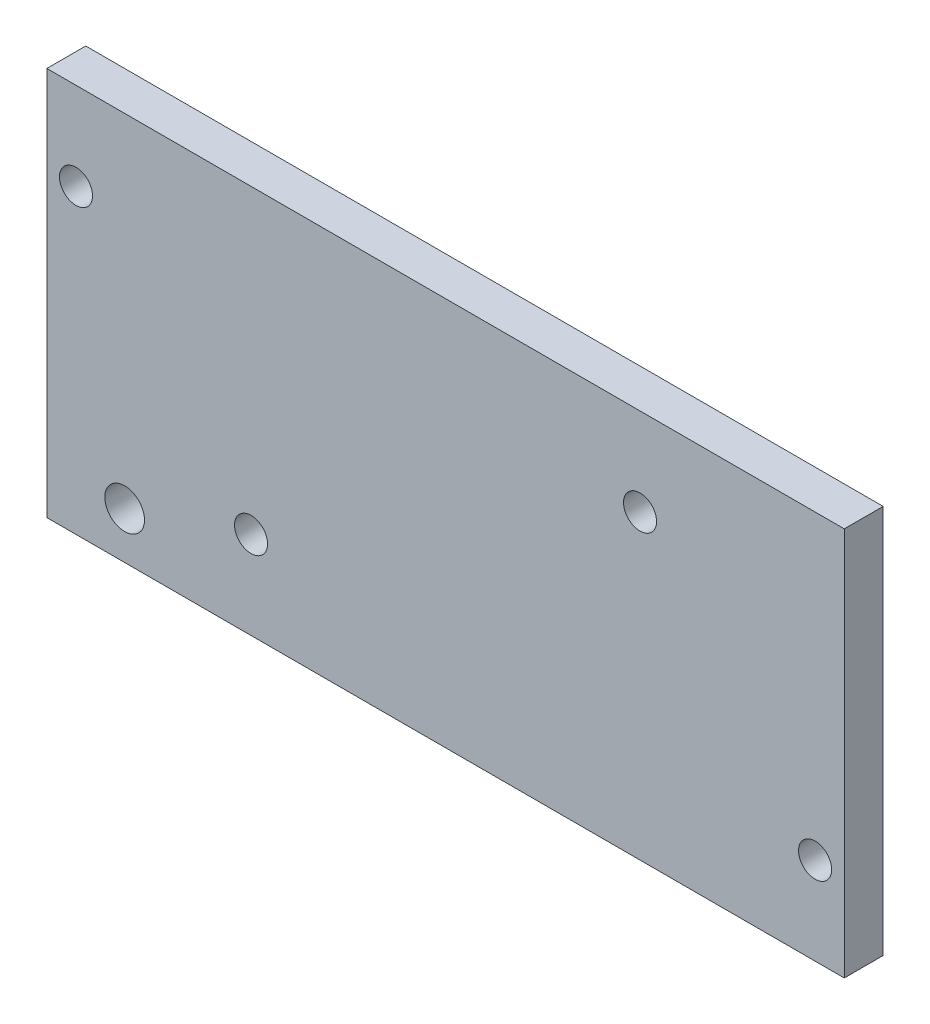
from build123d import *

# Parameters (mm, degrees)
ESQUISSE1_W                           = 10
ESQUISSE1_H                           = 100
EXTRUSION1_DEPTH                      = 205
DIAM_TRE_DU_PER_AGE_M8_5_8_500000_1_D = 8.5
TROU_TARAUD_M12X1_751_D               = 10.2


with BuildPart() as part:
    # Esquisse1 → Extrusion1 (new body)
    with BuildSketch(Plane(origin=(0, 0, 0), x_dir=(0, 0, -1), z_dir=(1, 0, 0))):
        with Locations((5, 50)):
            Rectangle(ESQUISSE1_W, ESQUISSE1_H)
    extrude(amount=EXTRUSION1_DEPTH)

    # Diam_tre du per_age M8.5 _8.500000_1 (through all)
    with Locations(Plane.XY):
        with Locations((7.5, 77.5), (152.5, 77.5), (52.5, 22.5), (197.5, 22.5)):
            Hole(DIAM_TRE_DU_PER_AGE_M8_5_8_500000_1_D / 2)

    # Trou taraud_ M12x1.751 (through all)
    with Locations(Plane.XY):
        with Locations((20, 12)):
            Hole(TROU_TARAUD_M12X1_751_D / 2)


solid = part.part
